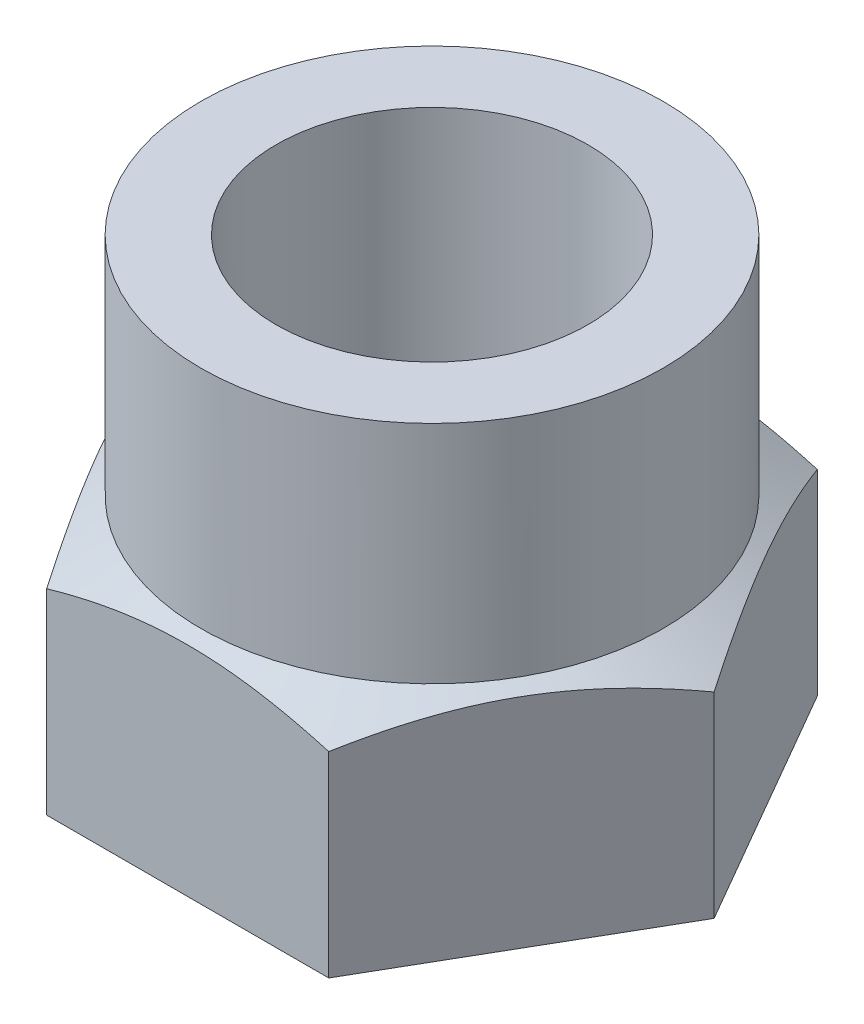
ISO-10303-21;
HEADER;
FILE_DESCRIPTION(('STEP AP214'),'2;1');
FILE_NAME('part.step','',(''),(''),'','','');
FILE_SCHEMA(('AUTOMOTIVE_DESIGN { 1 0 10303 214 1 1 1 1 }'));
ENDSEC;
DATA;
#1=APPLICATION_CONTEXT('core data for automotive mechanical design processes');
#2=APPLICATION_PROTOCOL_DEFINITION('international standard','automotive_design',2000,#1);
#3=PRODUCT_CONTEXT('',#1,'mechanical');
#4=PRODUCT('Part','Part','',(#3));
#5=PRODUCT_RELATED_PRODUCT_CATEGORY('part','',(#4));
#6=PRODUCT_DEFINITION_FORMATION('','',#4);
#7=PRODUCT_DEFINITION_CONTEXT('part definition',#1,'design');
#8=PRODUCT_DEFINITION('design','',#6,#7);
#9=PRODUCT_DEFINITION_SHAPE('','',#8);
#10=(LENGTH_UNIT() NAMED_UNIT(*) SI_UNIT(.MILLI.,.METRE.));
#11=(NAMED_UNIT(*) PLANE_ANGLE_UNIT() SI_UNIT($,.RADIAN.));
#12=(NAMED_UNIT(*) SI_UNIT($,.STERADIAN.) SOLID_ANGLE_UNIT());
#13=UNCERTAINTY_MEASURE_WITH_UNIT(LENGTH_MEASURE(1.E-05),#10,'distance_accuracy_value','');
#14=(GEOMETRIC_REPRESENTATION_CONTEXT(3) GLOBAL_UNCERTAINTY_ASSIGNED_CONTEXT((#13)) GLOBAL_UNIT_ASSIGNED_CONTEXT((#10,
#11,#12)) REPRESENTATION_CONTEXT('',''));
#15=CARTESIAN_POINT('',(0.,0.,0.));
#16=DIRECTION('',(0.,0.,1.));
#17=DIRECTION('',(1.,0.,0.));
#18=AXIS2_PLACEMENT_3D('',#15,#16,#17);
#19=CARTESIAN_POINT('',(0.,12.,0.));
#20=DIRECTION('',(0.,1.,0.));
#21=DIRECTION('',(0.,0.,1.));
#22=AXIS2_PLACEMENT_3D('',#19,#20,#21);
#23=PLANE('',#22);
#24=CARTESIAN_POINT('',(0.,12.,0.));
#25=DIRECTION('',(0.,1.,0.));
#26=DIRECTION('',(0.,0.,1.));
#27=AXIS2_PLACEMENT_3D('',#24,#25,#26);
#28=CIRCLE('',#27,6.15);
#29=CARTESIAN_POINT('',(0.,12.,6.15));
#30=VERTEX_POINT('',#29);
#31=EDGE_CURVE('E101',#30,#30,#28,.T.);
#32=ORIENTED_EDGE('',*,*,#31,.T.);
#33=EDGE_LOOP('',(#32));
#34=FACE_BOUND('',#33,.T.);
#35=CARTESIAN_POINT('',(0.,12.,0.));
#36=DIRECTION('',(0.,1.,0.));
#37=DIRECTION('',(0.,0.,1.));
#38=AXIS2_PLACEMENT_3D('',#35,#36,#37);
#39=CIRCLE('',#38,4.15);
#40=CARTESIAN_POINT('',(0.,12.,4.15));
#41=VERTEX_POINT('',#40);
#42=EDGE_CURVE('E97',#41,#41,#39,.T.);
#43=ORIENTED_EDGE('',*,*,#42,.F.);
#44=EDGE_LOOP('',(#43));
#45=FACE_BOUND('',#44,.T.);
#46=ADVANCED_FACE('F14',(#34,#45),#23,.T.);
#47=CARTESIAN_POINT('',(0.,12.,0.));
#48=DIRECTION('',(0.,-1.,0.));
#49=DIRECTION('',(0.,0.,-1.));
#50=AXIS2_PLACEMENT_3D('',#47,#48,#49);
#51=CYLINDRICAL_SURFACE('',#50,6.15);
#52=ORIENTED_EDGE('',*,*,#31,.F.);
#53=EDGE_LOOP('',(#52));
#54=FACE_BOUND('',#53,.T.);
#55=CARTESIAN_POINT('',(0.,6.,0.));
#56=DIRECTION('',(0.,-1.,0.));
#57=DIRECTION('',(0.,0.,-1.));
#58=AXIS2_PLACEMENT_3D('',#55,#56,#57);
#59=CIRCLE('',#58,6.15);
#60=CARTESIAN_POINT('',(0.,6.,-6.15));
#61=VERTEX_POINT('',#60);
#62=EDGE_CURVE('E92',#61,#61,#59,.T.);
#63=ORIENTED_EDGE('',*,*,#62,.F.);
#64=EDGE_LOOP('',(#63));
#65=FACE_BOUND('',#64,.T.);
#66=ADVANCED_FACE('F247',(#54,#65),#51,.T.);
#67=CARTESIAN_POINT('',(0.,12.,0.));
#68=DIRECTION('',(0.,-1.,0.));
#69=DIRECTION('',(0.,0.,-1.));
#70=AXIS2_PLACEMENT_3D('',#67,#68,#69);
#71=CYLINDRICAL_SURFACE('',#70,4.15);
#72=ORIENTED_EDGE('',*,*,#42,.T.);
#73=EDGE_LOOP('',(#72));
#74=FACE_BOUND('',#73,.T.);
#75=CARTESIAN_POINT('',(0.,0.,0.));
#76=DIRECTION('',(0.,-1.,0.));
#77=DIRECTION('',(0.,0.,-1.));
#78=AXIS2_PLACEMENT_3D('',#75,#76,#77);
#79=CIRCLE('',#78,4.15);
#80=CARTESIAN_POINT('',(0.,0.,-4.15));
#81=VERTEX_POINT('',#80);
#82=EDGE_CURVE('E103',#81,#81,#79,.T.);
#83=ORIENTED_EDGE('',*,*,#82,.T.);
#84=EDGE_LOOP('',(#83));
#85=FACE_BOUND('',#84,.T.);
#86=ADVANCED_FACE('F215',(#74,#85),#71,.F.);
#87=CARTESIAN_POINT('',(-6.4999999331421,0.,-6.5));
#88=DIRECTION('',(0.,-1.,0.));
#89=DIRECTION('',(1.,0.,0.));
#90=AXIS2_PLACEMENT_3D('',#87,#88,#89);
#91=PLANE('',#90);
#92=ORIENTED_EDGE('',*,*,#82,.F.);
#93=EDGE_LOOP('',(#92));
#94=FACE_BOUND('',#93,.T.);
#95=DIRECTION('',(-0.499999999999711,0.,0.866025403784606));
#96=VECTOR('',#95,1.);
#97=CARTESIAN_POINT('',(7.50555349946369,0.,-2.43893794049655E-12));
#98=LINE('',#97,#96);
#99=CARTESIAN_POINT('',(7.50555349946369,0.,-2.43893794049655E-12));
#100=VERTEX_POINT('',#99);
#101=CARTESIAN_POINT('',(3.75277674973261,0.,6.5));
#102=VERTEX_POINT('',#101);
#103=EDGE_CURVE('E169',#100,#102,#98,.T.);
#104=ORIENTED_EDGE('',*,*,#103,.T.);
#105=DIRECTION('',(-1.,0.,0.));
#106=VECTOR('',#105,1.);
#107=CARTESIAN_POINT('',(3.75277674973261,0.,6.5));
#108=LINE('',#107,#106);
#109=CARTESIAN_POINT('',(-3.75277671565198,0.,6.5));
#110=VERTEX_POINT('',#109);
#111=EDGE_CURVE('E142',#102,#110,#108,.T.);
#112=ORIENTED_EDGE('',*,*,#111,.T.);
#113=DIRECTION('',(-0.500000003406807,0.,-0.866025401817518));
#114=VECTOR('',#113,1.);
#115=CARTESIAN_POINT('',(-3.75277671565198,0.,6.5));
#116=LINE('',#115,#114);
#117=CARTESIAN_POINT('',(-7.50555349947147,0.,1.10399795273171E-11));
#118=VERTEX_POINT('',#117);
#119=EDGE_CURVE('E149',#110,#118,#116,.T.);
#120=ORIENTED_EDGE('',*,*,#119,.T.);
#121=DIRECTION('',(0.499999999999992,0.,-0.866025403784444));
#122=VECTOR('',#121,1.);
#123=CARTESIAN_POINT('',(-7.50555349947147,0.,1.10399795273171E-11));
#124=LINE('',#123,#122);
#125=CARTESIAN_POINT('',(-3.75277674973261,0.,-6.5));
#126=VERTEX_POINT('',#125);
#127=EDGE_CURVE('E153',#118,#126,#124,.T.);
#128=ORIENTED_EDGE('',*,*,#127,.T.);
#129=DIRECTION('',(1.,0.,0.));
#130=VECTOR('',#129,1.);
#131=CARTESIAN_POINT('',(-3.75277674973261,0.,-6.5));
#132=LINE('',#131,#130);
#133=CARTESIAN_POINT('',(3.75277671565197,0.,-6.5));
#134=VERTEX_POINT('',#133);
#135=EDGE_CURVE('E163',#126,#134,#132,.T.);
#136=ORIENTED_EDGE('',*,*,#135,.T.);
#137=DIRECTION('',(0.500000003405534,0.,0.866025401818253));
#138=VECTOR('',#137,1.);
#139=CARTESIAN_POINT('',(3.75277671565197,0.,-6.5));
#140=LINE('',#139,#138);
#141=EDGE_CURVE('E166',#134,#100,#140,.T.);
#142=ORIENTED_EDGE('',*,*,#141,.T.);
#143=EDGE_LOOP('',(#104,#112,#120,#128,#136,#142));
#144=FACE_BOUND('',#143,.T.);
#145=ADVANCED_FACE('F16',(#94,#144),#91,.T.);
#146=CARTESIAN_POINT('',(-3.75277673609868,-7.40799890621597E-08,6.50000002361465));
#147=DIRECTION('',(-0.866025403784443,0.,0.499999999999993));
#148=DIRECTION('',(0.,1.,0.));
#149=AXIS2_PLACEMENT_3D('',#146,#147,#148);
#150=PLANE('',#149);
#151=CARTESIAN_POINT('',(-7.50566896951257,5.21730415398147,-0.000199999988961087));
#152=CARTESIAN_POINT('',(-7.42317859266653,5.26492300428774,0.142677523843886));
#153=CARTESIAN_POINT('',(-7.34038065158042,5.31038074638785,0.286087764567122));
#154=CARTESIAN_POINT('',(-7.17411236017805,5.39637879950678,0.574072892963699));
#155=CARTESIAN_POINT('',(-7.09064173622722,5.43691698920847,0.718648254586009));
#156=CARTESIAN_POINT('',(-6.83889338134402,5.55035653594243,1.15468919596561));
#157=CARTESIAN_POINT('',(-6.66962191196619,5.61487974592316,1.44787598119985));
#158=CARTESIAN_POINT('',(-6.41631031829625,5.69054094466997,1.88662453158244));
#159=CARTESIAN_POINT('',(-6.33302706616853,5.71209464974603,2.03087535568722));
#160=CARTESIAN_POINT('',(-6.16608424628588,5.7482371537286,2.32002880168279));
#161=CARTESIAN_POINT('',(-6.08242471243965,5.76282656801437,2.464931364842));
#162=CARTESIAN_POINT('',(-5.91496034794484,5.78466867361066,2.75498815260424));
#163=CARTESIAN_POINT('',(-5.83115579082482,5.79192969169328,2.90014190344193));
#164=CARTESIAN_POINT('',(-5.66347388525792,5.79896710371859,3.19057548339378));
#165=CARTESIAN_POINT('',(-5.57959653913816,5.79874372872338,3.33585530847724));
#166=CARTESIAN_POINT('',(-5.34977972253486,5.78784301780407,3.7339097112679));
#167=CARTESIAN_POINT('',(-5.20391549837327,5.7695406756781,3.9865539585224));
#168=CARTESIAN_POINT('',(-4.91315606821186,5.71150270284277,4.49016406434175));
#169=CARTESIAN_POINT('',(-4.76826188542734,5.67174722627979,4.74112815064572));
#170=CARTESIAN_POINT('',(-4.47691725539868,5.57237002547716,5.24575185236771));
#171=CARTESIAN_POINT('',(-4.33050358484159,5.51232717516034,5.49934776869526));
#172=CARTESIAN_POINT('',(-4.0398601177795,5.37605483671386,6.00275702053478));
#173=CARTESIAN_POINT('',(-3.89562659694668,5.29985737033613,6.25257680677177));
#174=CARTESIAN_POINT('',(-3.75243036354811,5.21717082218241,6.50059995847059));
#175=B_SPLINE_CURVE_WITH_KNOTS('',3,(#151,#152,#153,#154,#155,#156,#157,#158,#159,#160,#161,
#162,#163,#164,#165,#166,#167,#168,#169,#170,#171,#172,#173,#174),.UNSPECIFIED.,.F.,.F.,(4,2,2,
2,2,2,2,2,2,2,2,4),(0.,0.515105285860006,1.03043190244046,2.06322654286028,2.56697465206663,
3.07067824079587,3.5738088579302,4.07692394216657,4.95291052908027,5.82970886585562,
6.72595703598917,7.62044499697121),.UNSPECIFIED.);
#176=CARTESIAN_POINT('',(-7.50555349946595,5.21737082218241,1.48318857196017E-12));
#177=VERTEX_POINT('',#176);
#178=CARTESIAN_POINT('',(-3.7527767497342,5.21737082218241,6.5));
#179=VERTEX_POINT('',#178);
#180=EDGE_CURVE('E113',#177,#179,#175,.T.);
#181=ORIENTED_EDGE('',*,*,#180,.F.);
#182=DIRECTION('',(1.52340005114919E-12,1.,-2.63870777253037E-12));
#183=VECTOR('',#182,1.);
#184=CARTESIAN_POINT('',(-7.50555349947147,0.46889729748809,1.10399795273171E-11));
#185=LINE('',#184,#183);
#186=EDGE_CURVE('E18',#177,#118,#185,.F.);
#187=ORIENTED_EDGE('',*,*,#186,.T.);
#188=ORIENTED_EDGE('',*,*,#119,.F.);
#189=DIRECTION('',(0.,-1.,0.));
#190=VECTOR('',#189,1.);
#191=CARTESIAN_POINT('',(-3.75277671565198,1.,6.5));
#192=LINE('',#191,#190);
#193=CARTESIAN_POINT('',(-3.75277671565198,0.468897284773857,6.5));
#194=VERTEX_POINT('',#193);
#195=EDGE_CURVE('E141',#194,#110,#192,.T.);
#196=ORIENTED_EDGE('',*,*,#195,.F.);
#197=DIRECTION('',(5.80826001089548E-09,-1.,0.));
#198=VECTOR('',#197,1.);
#199=CARTESIAN_POINT('',(-3.75277673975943,4.61944342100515,6.5));
#200=LINE('',#199,#198);
#201=CARTESIAN_POINT('',(-3.75277673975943,4.61944342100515,6.5));
#202=VERTEX_POINT('',#201);
#203=EDGE_CURVE('E24',#202,#194,#200,.T.);
#204=ORIENTED_EDGE('',*,*,#203,.F.);
#205=DIRECTION('',(0.,-1.,0.));
#206=VECTOR('',#205,1.);
#207=CARTESIAN_POINT('',(-3.75277671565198,6.,6.5));
#208=LINE('',#207,#206);
#209=EDGE_CURVE('E98',#179,#202,#208,.T.);
#210=ORIENTED_EDGE('',*,*,#209,.F.);
#211=EDGE_LOOP('',(#181,#187,#188,#196,#204,#210));
#212=FACE_BOUND('',#211,.T.);
#213=ADVANCED_FACE('F182',(#212),#150,.T.);
#214=CARTESIAN_POINT('',(-7.50555349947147,-7.40809728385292E-08,1.10399795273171E-11));
#215=DIRECTION('',(-0.866025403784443,0.,-0.499999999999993));
#216=DIRECTION('',(0.,1.,0.));
#217=AXIS2_PLACEMENT_3D('',#214,#215,#216);
#218=PLANE('',#217);
#219=CARTESIAN_POINT('',(-3.75266127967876,5.21730415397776,-6.5002));
#220=CARTESIAN_POINT('',(-3.83515161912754,5.26492298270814,-6.35732254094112));
#221=CARTESIAN_POINT('',(-3.91794952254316,5.31038070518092,-6.21391236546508));
#222=CARTESIAN_POINT('',(-4.08421773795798,5.39637872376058,-5.92592736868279));
#223=CARTESIAN_POINT('',(-4.16768832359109,5.4369168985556,-5.78135207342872));
#224=CARTESIAN_POINT('',(-4.41943655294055,5.55035640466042,-5.34531134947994));
#225=CARTESIAN_POINT('',(-4.58870793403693,5.61487959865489,-5.05212471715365));
#226=CARTESIAN_POINT('',(-4.84201947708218,5.69054082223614,-4.61337625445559));
#227=CARTESIAN_POINT('',(-4.92530276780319,5.71209454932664,-4.46912536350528));
#228=CARTESIAN_POINT('',(-5.09224566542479,5.74823709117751,-4.17997178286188));
#229=CARTESIAN_POINT('',(-5.17590523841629,5.76282652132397,-4.03506915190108));
#230=CARTESIAN_POINT('',(-5.34336968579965,5.78466865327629,-3.74501222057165));
#231=CARTESIAN_POINT('',(-5.42717428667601,5.79192968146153,-3.59985839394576));
#232=CARTESIAN_POINT('',(-5.59485627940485,5.7989671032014,-3.30942466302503));
#233=CARTESIAN_POINT('',(-5.67873366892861,5.79874372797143,-3.16414476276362));
#234=CARTESIAN_POINT('',(-5.90853103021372,5.78784394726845,-2.76612405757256));
#235=CARTESIAN_POINT('',(-6.05437578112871,5.76954558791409,-2.51351353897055));
#236=CARTESIAN_POINT('',(-6.34509659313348,5.71152106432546,-2.0099703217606));
#237=CARTESIAN_POINT('',(-6.4899716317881,5.67177506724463,-1.75903939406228));
#238=CARTESIAN_POINT('',(-6.7812775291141,5.57242150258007,-1.25448277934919));
#239=CARTESIAN_POINT('',(-6.92767163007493,5.5123929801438,-1.00092075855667));
#240=CARTESIAN_POINT('',(-7.21827667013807,5.37615241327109,-0.497578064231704));
#241=CARTESIAN_POINT('',(-7.36249133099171,5.29997237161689,-0.247790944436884));
#242=CARTESIAN_POINT('',(-7.50566896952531,5.21730415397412,0.000200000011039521));
#243=B_SPLINE_CURVE_WITH_KNOTS('',3,(#219,#220,#221,#222,#223,#224,#225,#226,#227,#228,#229,
#230,#231,#232,#233,#234,#235,#236,#237,#238,#239,#240,#241,#242),.UNSPECIFIED.,.F.,.F.,(4,2,2,
2,2,2,2,2,2,2,2,4),(0.,0.515105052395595,1.03043143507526,2.06322554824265,2.56697389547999,
3.07067772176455,3.57380860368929,4.07692394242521,4.95279354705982,5.82947446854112,
6.72559912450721,7.61996451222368),.UNSPECIFIED.);
#244=CARTESIAN_POINT('',(-3.7527767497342,5.21737082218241,-6.5));
#245=VERTEX_POINT('',#244);
#246=EDGE_CURVE('E193',#245,#177,#243,.T.);
#247=ORIENTED_EDGE('',*,*,#246,.F.);
#248=DIRECTION('',(0.,-1.,0.));
#249=VECTOR('',#248,1.);
#250=CARTESIAN_POINT('',(-3.7527767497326,4.61944341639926,-6.5));
#251=LINE('',#250,#249);
#252=EDGE_CURVE('E91',#245,#126,#251,.T.);
#253=ORIENTED_EDGE('',*,*,#252,.T.);
#254=ORIENTED_EDGE('',*,*,#127,.F.);
#255=ORIENTED_EDGE('',*,*,#186,.F.);
#256=EDGE_LOOP('',(#247,#253,#254,#255));
#257=FACE_BOUND('',#256,.T.);
#258=ADVANCED_FACE('F187',(#257),#218,.T.);
#259=CARTESIAN_POINT('',(3.75277674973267,-2.61682385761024E-08,6.5));
#260=DIRECTION('',(0.,0.,1.));
#261=DIRECTION('',(0.,1.,0.));
#262=AXIS2_PLACEMENT_3D('',#259,#260,#261);
#263=PLANE('',#262);
#264=CARTESIAN_POINT('',(-3.7534695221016,5.21717082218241,6.5));
#265=CARTESIAN_POINT('',(-3.58848503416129,5.26479514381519,6.5));
#266=CARTESIAN_POINT('',(-3.42288539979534,5.31025849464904,6.5));
#267=CARTESIAN_POINT('',(-3.09034123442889,5.39626802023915,6.5));
#268=CARTESIAN_POINT('',(-2.92339615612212,5.43681207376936,6.5));
#269=CARTESIAN_POINT('',(-2.41988754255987,5.55026963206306,6.5));
#270=CARTESIAN_POINT('',(-2.08133635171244,5.6148053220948,6.5));
#271=CARTESIAN_POINT('',(-1.57470039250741,5.69048521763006,6.5));
#272=CARTESIAN_POINT('',(-1.4081297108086,5.71204506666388,6.5));
#273=CARTESIAN_POINT('',(-1.07423547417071,5.74819978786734,6.5));
#274=CARTESIAN_POINT('',(-0.906911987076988,5.76279527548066,6.5));
#275=CARTESIAN_POINT('',(-0.571974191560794,5.78464930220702,6.5));
#276=CARTESIAN_POINT('',(-0.404360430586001,5.79191616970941,6.5));
#277=CARTESIAN_POINT('',(-0.0689870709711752,5.79896491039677,6.5));
#278=CARTESIAN_POINT('',(0.0987725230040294,5.79874701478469,6.5));
#279=CARTESIAN_POINT('',(0.55839892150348,5.78786112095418,6.5));
#280=CARTESIAN_POINT('',(0.850115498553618,5.76956923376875,6.5));
#281=CARTESIAN_POINT('',(1.43161140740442,5.71155305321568,6.5));
#282=CARTESIAN_POINT('',(1.72138869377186,5.67180891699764,6.5));
#283=CARTESIAN_POINT('',(2.30405590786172,5.57245480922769,6.5));
#284=CARTESIAN_POINT('',(2.59687230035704,5.51242373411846,6.5));
#285=CARTESIAN_POINT('',(3.17813790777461,5.37617460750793,6.5));
#286=CARTESIAN_POINT('',(3.46659456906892,5.29998857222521,6.5));
#287=CARTESIAN_POINT('',(3.75297674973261,5.21731308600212,6.5));
#288=B_SPLINE_CURVE_WITH_KNOTS('',3,(#264,#265,#266,#267,#268,#269,#270,#271,#272,#273,#274,
#275,#276,#277,#278,#279,#280,#281,#282,#283,#284,#285,#286,#287),.UNSPECIFIED.,.F.,.F.,(4,2,2,
2,2,2,2,2,2,2,2,4),(0.,0.515120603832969,1.03046254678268,2.06328858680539,2.56705149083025,
3.07076986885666,3.57391516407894,4.07704491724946,4.9529940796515,5.82975486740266,
6.7259637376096,7.62041281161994),.UNSPECIFIED.);
#289=CARTESIAN_POINT('',(3.7527767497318,5.21737082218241,6.50000000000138));
#290=VERTEX_POINT('',#289);
#291=EDGE_CURVE('E192',#179,#290,#288,.T.);
#292=ORIENTED_EDGE('',*,*,#291,.F.);
#293=ORIENTED_EDGE('',*,*,#209,.T.);
#294=ORIENTED_EDGE('',*,*,#203,.T.);
#295=ORIENTED_EDGE('',*,*,#195,.T.);
#296=ORIENTED_EDGE('',*,*,#111,.F.);
#297=DIRECTION('',(0.,-1.,0.));
#298=VECTOR('',#297,1.);
#299=CARTESIAN_POINT('',(3.75277674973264,4.61944341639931,6.49999999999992));
#300=LINE('',#299,#298);
#301=EDGE_CURVE('E123',#290,#102,#300,.T.);
#302=ORIENTED_EDGE('',*,*,#301,.F.);
#303=EDGE_LOOP('',(#292,#293,#294,#295,#296,#302));
#304=FACE_BOUND('',#303,.T.);
#305=ADVANCED_FACE('F191',(#304),#263,.T.);
#306=CARTESIAN_POINT('',(7.50555349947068,-9.64703128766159E-08,-9.66782590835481E-12));
#307=DIRECTION('',(0.866025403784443,0.,0.499999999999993));
#308=DIRECTION('',(0.,1.,0.));
#309=AXIS2_PLACEMENT_3D('',#306,#307,#308);
#310=PLANE('',#309);
#311=CARTESIAN_POINT('',(3.75266127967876,5.21730415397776,6.5002));
#312=CARTESIAN_POINT('',(3.83515161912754,5.26492298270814,6.35732254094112));
#313=CARTESIAN_POINT('',(3.91794952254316,5.31038070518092,6.21391236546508));
#314=CARTESIAN_POINT('',(4.08421773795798,5.39637872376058,5.9259273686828));
#315=CARTESIAN_POINT('',(4.16768832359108,5.4369168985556,5.78135207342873));
#316=CARTESIAN_POINT('',(4.41943655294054,5.55035640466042,5.34531134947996));
#317=CARTESIAN_POINT('',(4.58870793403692,5.61487959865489,5.05212471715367));
#318=CARTESIAN_POINT('',(4.84201947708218,5.69054082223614,4.61337625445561));
#319=CARTESIAN_POINT('',(4.92530276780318,5.71209454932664,4.46912536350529));
#320=CARTESIAN_POINT('',(5.09224566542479,5.74823709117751,4.1799717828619));
#321=CARTESIAN_POINT('',(5.17590523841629,5.76282652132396,4.03506915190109));
#322=CARTESIAN_POINT('',(5.34336968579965,5.78466865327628,3.74501222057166));
#323=CARTESIAN_POINT('',(5.42717428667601,5.79192968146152,3.59985839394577));
#324=CARTESIAN_POINT('',(5.59485627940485,5.7989671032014,3.30942466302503));
#325=CARTESIAN_POINT('',(5.67873366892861,5.79874372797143,3.16414476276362));
#326=CARTESIAN_POINT('',(5.90853103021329,5.78784394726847,2.76612405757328));
#327=CARTESIAN_POINT('',(6.05437578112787,5.76954558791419,2.513513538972));
#328=CARTESIAN_POINT('',(6.34509659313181,5.71152106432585,2.00997032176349));
#329=CARTESIAN_POINT('',(6.48997163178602,5.67177506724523,1.75903939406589));
#330=CARTESIAN_POINT('',(6.78127752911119,5.57242150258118,1.25448277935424));
#331=CARTESIAN_POINT('',(6.9276716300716,5.51239298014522,1.00092075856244));
#332=CARTESIAN_POINT('',(7.21827667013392,5.37615241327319,0.497578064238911));
#333=CARTESIAN_POINT('',(7.36249133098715,5.29997237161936,0.247790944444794));
#334=CARTESIAN_POINT('',(7.50566896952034,5.21730415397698,-0.000200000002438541));
#335=B_SPLINE_CURVE_WITH_KNOTS('',3,(#311,#312,#313,#314,#315,#316,#317,#318,#319,#320,#321,
#322,#323,#324,#325,#326,#327,#328,#329,#330,#331,#332,#333,#334),.UNSPECIFIED.,.F.,.F.,(4,2,2,
2,2,2,2,2,2,2,2,4),(0.,0.515105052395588,1.03043143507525,2.06322554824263,2.56697389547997,
3.07067772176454,3.57380860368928,4.0769239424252,4.95279354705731,5.82947446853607,
6.72559912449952,7.61996451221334),.UNSPECIFIED.);
#336=CARTESIAN_POINT('',(7.50555349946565,5.21737082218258,9.3664374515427E-13));
#337=VERTEX_POINT('',#336);
#338=EDGE_CURVE('E31',#290,#337,#335,.T.);
#339=ORIENTED_EDGE('',*,*,#338,.F.);
#340=ORIENTED_EDGE('',*,*,#301,.T.);
#341=ORIENTED_EDGE('',*,*,#103,.F.);
#342=DIRECTION('',(-4.10434232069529E-13,-1.,-7.10877225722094E-13));
#343=VECTOR('',#342,1.);
#344=CARTESIAN_POINT('',(7.5055534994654,4.6194434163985,5.11590769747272E-13));
#345=LINE('',#344,#343);
#346=EDGE_CURVE('E108',#337,#100,#345,.T.);
#347=ORIENTED_EDGE('',*,*,#346,.F.);
#348=EDGE_LOOP('',(#339,#340,#341,#347));
#349=FACE_BOUND('',#348,.T.);
#350=ADVANCED_FACE('F189',(#349),#310,.T.);
#351=CARTESIAN_POINT('',(-3.75277674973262,-2.61682383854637E-08,-6.5));
#352=DIRECTION('',(0.,0.,-1.));
#353=DIRECTION('',(0.,1.,0.));
#354=AXIS2_PLACEMENT_3D('',#351,#352,#353);
#355=PLANE('',#354);
#356=CARTESIAN_POINT('',(3.7534695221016,5.21717082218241,-6.5));
#357=CARTESIAN_POINT('',(3.58848503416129,5.26479514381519,-6.5));
#358=CARTESIAN_POINT('',(3.42288539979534,5.31025849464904,-6.5));
#359=CARTESIAN_POINT('',(3.09034123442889,5.39626802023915,-6.5));
#360=CARTESIAN_POINT('',(2.92339615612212,5.43681207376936,-6.5));
#361=CARTESIAN_POINT('',(2.41988754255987,5.55026963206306,-6.5));
#362=CARTESIAN_POINT('',(2.08133635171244,5.6148053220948,-6.5));
#363=CARTESIAN_POINT('',(1.57470039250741,5.69048521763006,-6.5));
#364=CARTESIAN_POINT('',(1.4081297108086,5.71204506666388,-6.5));
#365=CARTESIAN_POINT('',(1.07423547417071,5.74819978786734,-6.5));
#366=CARTESIAN_POINT('',(0.906911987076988,5.76279527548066,-6.5));
#367=CARTESIAN_POINT('',(0.571974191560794,5.78464930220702,-6.5));
#368=CARTESIAN_POINT('',(0.404360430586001,5.79191616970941,-6.5));
#369=CARTESIAN_POINT('',(0.0689870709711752,5.79896491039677,-6.5));
#370=CARTESIAN_POINT('',(-0.0987725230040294,5.79874701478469,-6.5));
#371=CARTESIAN_POINT('',(-0.55839892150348,5.78786112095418,-6.5));
#372=CARTESIAN_POINT('',(-0.850115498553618,5.76956923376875,-6.5));
#373=CARTESIAN_POINT('',(-1.43161140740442,5.71155305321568,-6.5));
#374=CARTESIAN_POINT('',(-1.72138869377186,5.67180891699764,-6.5));
#375=CARTESIAN_POINT('',(-2.30405590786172,5.57245480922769,-6.5));
#376=CARTESIAN_POINT('',(-2.59687230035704,5.51242373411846,-6.5));
#377=CARTESIAN_POINT('',(-3.17813790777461,5.37617460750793,-6.5));
#378=CARTESIAN_POINT('',(-3.46659456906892,5.29998857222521,-6.5));
#379=CARTESIAN_POINT('',(-3.75297674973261,5.21731308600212,-6.5));
#380=B_SPLINE_CURVE_WITH_KNOTS('',3,(#356,#357,#358,#359,#360,#361,#362,#363,#364,#365,#366,
#367,#368,#369,#370,#371,#372,#373,#374,#375,#376,#377,#378,#379),.UNSPECIFIED.,.F.,.F.,(4,2,2,
2,2,2,2,2,2,2,2,4),(0.,0.515120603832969,1.03046254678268,2.06328858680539,2.56705149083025,
3.07076986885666,3.57391516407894,4.07704491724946,4.9529940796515,5.82975486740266,
6.7259637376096,7.62041281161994),.UNSPECIFIED.);
#381=CARTESIAN_POINT('',(3.7527767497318,5.21737082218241,-6.50000000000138));
#382=VERTEX_POINT('',#381);
#383=EDGE_CURVE('E80',#382,#245,#380,.T.);
#384=ORIENTED_EDGE('',*,*,#383,.F.);
#385=DIRECTION('',(0.,-1.,0.));
#386=VECTOR('',#385,1.);
#387=CARTESIAN_POINT('',(3.75277671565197,6.,-6.5));
#388=LINE('',#387,#386);
#389=CARTESIAN_POINT('',(3.75277673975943,4.61944342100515,-6.5));
#390=VERTEX_POINT('',#389);
#391=EDGE_CURVE('E88',#382,#390,#388,.T.);
#392=ORIENTED_EDGE('',*,*,#391,.T.);
#393=DIRECTION('',(-5.80826065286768E-09,-1.,0.));
#394=VECTOR('',#393,1.);
#395=CARTESIAN_POINT('',(3.75277673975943,4.61944342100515,-6.5));
#396=LINE('',#395,#394);
#397=CARTESIAN_POINT('',(3.75277671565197,0.468897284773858,-6.5));
#398=VERTEX_POINT('',#397);
#399=EDGE_CURVE('E96',#390,#398,#396,.T.);
#400=ORIENTED_EDGE('',*,*,#399,.T.);
#401=DIRECTION('',(0.,-1.,0.));
#402=VECTOR('',#401,1.);
#403=CARTESIAN_POINT('',(3.75277671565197,1.,-6.5));
#404=LINE('',#403,#402);
#405=EDGE_CURVE('E137',#398,#134,#404,.T.);
#406=ORIENTED_EDGE('',*,*,#405,.T.);
#407=ORIENTED_EDGE('',*,*,#135,.F.);
#408=ORIENTED_EDGE('',*,*,#252,.F.);
#409=EDGE_LOOP('',(#384,#392,#400,#406,#407,#408));
#410=FACE_BOUND('',#409,.T.);
#411=ADVANCED_FACE('F87',(#410),#355,.T.);
#412=CARTESIAN_POINT('',(3.75277673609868,-7.40805380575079E-08,-6.50000002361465));
#413=DIRECTION('',(0.866025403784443,0.,-0.499999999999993));
#414=DIRECTION('',(0.,1.,0.));
#415=AXIS2_PLACEMENT_3D('',#412,#413,#414);
#416=PLANE('',#415);
#417=CARTESIAN_POINT('',(7.50566896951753,5.21730415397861,0.000199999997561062));
#418=CARTESIAN_POINT('',(7.42317859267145,5.26492300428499,-0.14267752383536));
#419=CARTESIAN_POINT('',(7.3403806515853,5.31038074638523,-0.286087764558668));
#420=CARTESIAN_POINT('',(7.17411236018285,5.3963787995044,-0.574072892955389));
#421=CARTESIAN_POINT('',(7.09064173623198,5.43691698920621,-0.718648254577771));
#422=CARTESIAN_POINT('',(6.83889338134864,5.55035653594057,-1.1546891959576));
#423=CARTESIAN_POINT('',(6.66962191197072,5.61487974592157,-1.447875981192));
#424=CARTESIAN_POINT('',(6.41631031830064,5.69054094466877,-1.88662453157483));
#425=CARTESIAN_POINT('',(6.33302706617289,5.71209464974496,-2.03087535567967));
#426=CARTESIAN_POINT('',(6.16608424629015,5.7482371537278,-2.3200288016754));
#427=CARTESIAN_POINT('',(6.08242471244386,5.7628265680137,-2.4649313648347));
#428=CARTESIAN_POINT('',(5.91496034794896,5.78466867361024,-2.7549881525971));
#429=CARTESIAN_POINT('',(5.83115579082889,5.79192969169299,-2.90014190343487));
#430=CARTESIAN_POINT('',(5.66347388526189,5.79896710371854,-3.1905754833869));
#431=CARTESIAN_POINT('',(5.57959653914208,5.79874372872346,-3.33585530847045));
#432=CARTESIAN_POINT('',(5.34977972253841,5.78784301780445,-3.73390971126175));
#433=CARTESIAN_POINT('',(5.2039154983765,5.7695406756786,-3.9865539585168));
#434=CARTESIAN_POINT('',(4.91315606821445,5.71150270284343,-4.49016406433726));
#435=CARTESIAN_POINT('',(4.76826188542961,5.67174722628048,-4.74112815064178));
#436=CARTESIAN_POINT('',(4.4769172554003,5.5723700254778,-5.24575185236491));
#437=CARTESIAN_POINT('',(4.33050358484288,5.5123271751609,-5.49934776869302));
#438=CARTESIAN_POINT('',(4.03986011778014,5.37605483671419,-6.00275702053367));
#439=CARTESIAN_POINT('',(3.895626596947,5.29985737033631,-6.25257680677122));
#440=CARTESIAN_POINT('',(3.75243036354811,5.21717082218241,-6.50059995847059));
#441=B_SPLINE_CURVE_WITH_KNOTS('',3,(#417,#418,#419,#420,#421,#422,#423,#424,#425,#426,#427,
#428,#429,#430,#431,#432,#433,#434,#435,#436,#437,#438,#439,#440),.UNSPECIFIED.,.F.,.F.,(4,2,2,
2,2,2,2,2,2,2,2,4),(0.,0.51510528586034,1.03043190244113,2.06322654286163,2.56697465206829,
3.07067824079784,3.57380885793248,4.07692394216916,4.95291052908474,5.82970886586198,
6.72595703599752,7.62044499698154),.UNSPECIFIED.);
#442=EDGE_CURVE('E9',#337,#382,#441,.T.);
#443=ORIENTED_EDGE('',*,*,#442,.F.);
#444=ORIENTED_EDGE('',*,*,#346,.T.);
#445=ORIENTED_EDGE('',*,*,#141,.F.);
#446=ORIENTED_EDGE('',*,*,#405,.F.);
#447=ORIENTED_EDGE('',*,*,#399,.F.);
#448=ORIENTED_EDGE('',*,*,#391,.F.);
#449=EDGE_LOOP('',(#443,#444,#445,#446,#447,#448));
#450=FACE_BOUND('',#449,.T.);
#451=ADVANCED_FACE('F94',(#450),#416,.T.);
#452=CARTESIAN_POINT('',(0.,6.,0.));
#453=DIRECTION('',(0.,-1.,0.));
#454=DIRECTION('',(0.,0.,-1.));
#455=AXIS2_PLACEMENT_3D('',#452,#453,#454);
#456=CONICAL_SURFACE('',#455,6.15,1.0471975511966);
#457=ORIENTED_EDGE('',*,*,#180,.T.);
#458=ORIENTED_EDGE('',*,*,#291,.T.);
#459=ORIENTED_EDGE('',*,*,#338,.T.);
#460=ORIENTED_EDGE('',*,*,#442,.T.);
#461=ORIENTED_EDGE('',*,*,#383,.T.);
#462=ORIENTED_EDGE('',*,*,#246,.T.);
#463=EDGE_LOOP('',(#457,#458,#459,#460,#461,#462));
#464=FACE_BOUND('',#463,.T.);
#465=ORIENTED_EDGE('',*,*,#62,.T.);
#466=EDGE_LOOP('',(#465));
#467=FACE_BOUND('',#466,.T.);
#468=ADVANCED_FACE('F78',(#464,#467),#456,.T.);
#469=CLOSED_SHELL('',(#46,#66,#86,#145,#213,#258,#305,#350,#411,#451,#468));
#470=MANIFOLD_SOLID_BREP('B1',#469);
#471=ADVANCED_BREP_SHAPE_REPRESENTATION('',(#18,#470),#14);
#472=SHAPE_DEFINITION_REPRESENTATION(#9,#471);
ENDSEC;
END-ISO-10303-21;
